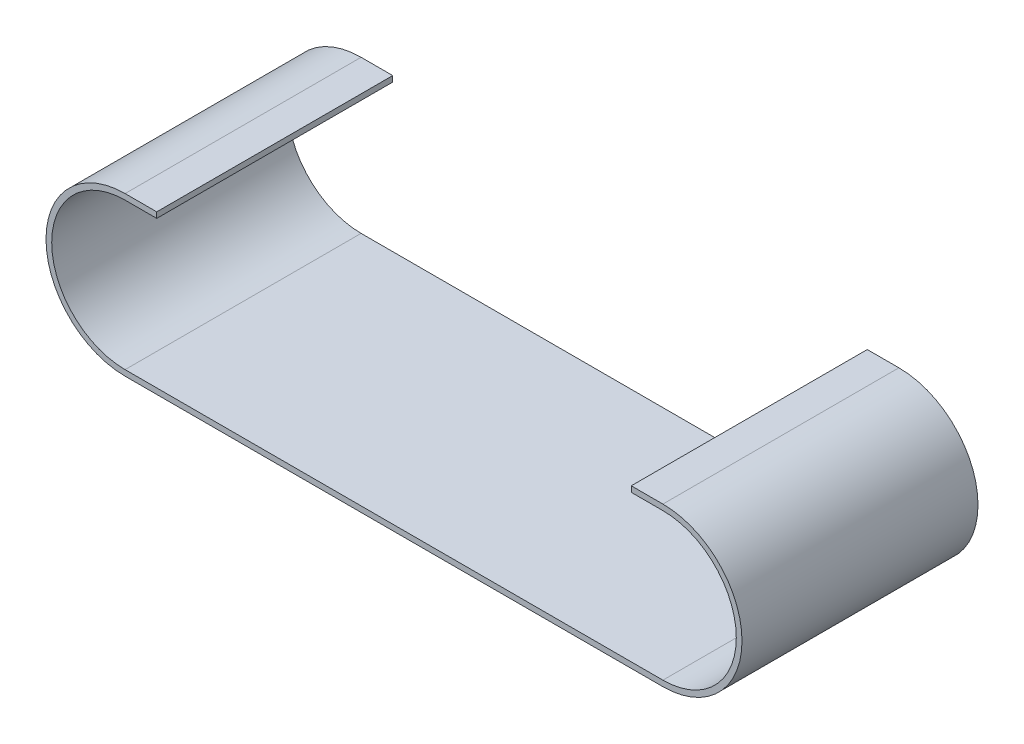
from build123d import *

# Parameters (mm, degrees)
BOSS_EXTRU_1_DEPTH = 746


with BuildPart() as part:
    # Esquisse1 → Boss.-Extru.1 (new body)
    with BuildSketch(Plane.XY):
        with BuildLine():
            Line((-850, 250), (-750, 250))
            Line((-750, 250), (-750, 232))
            Line((-750, 232), (-850, 232))
            ThreePointArc((-850, 232), (-1082, 0), (-850, -232))
            Line((-850, -232), (850, -232))
            ThreePointArc((850, -232), (1082, 0), (850, 232))
            Line((850, 232), (750, 232))
            Line((750, 232), (750, 250))
            Line((750, 250), (850, 250))
            ThreePointArc((850, 250), (1100, 0), (850, -250))
            Line((850, -250), (-850, -250))
            ThreePointArc((-850, -250), (-1100, 0), (-850, 250))
        make_face()
    extrude(amount=-BOSS_EXTRU_1_DEPTH)


solid = part.part
